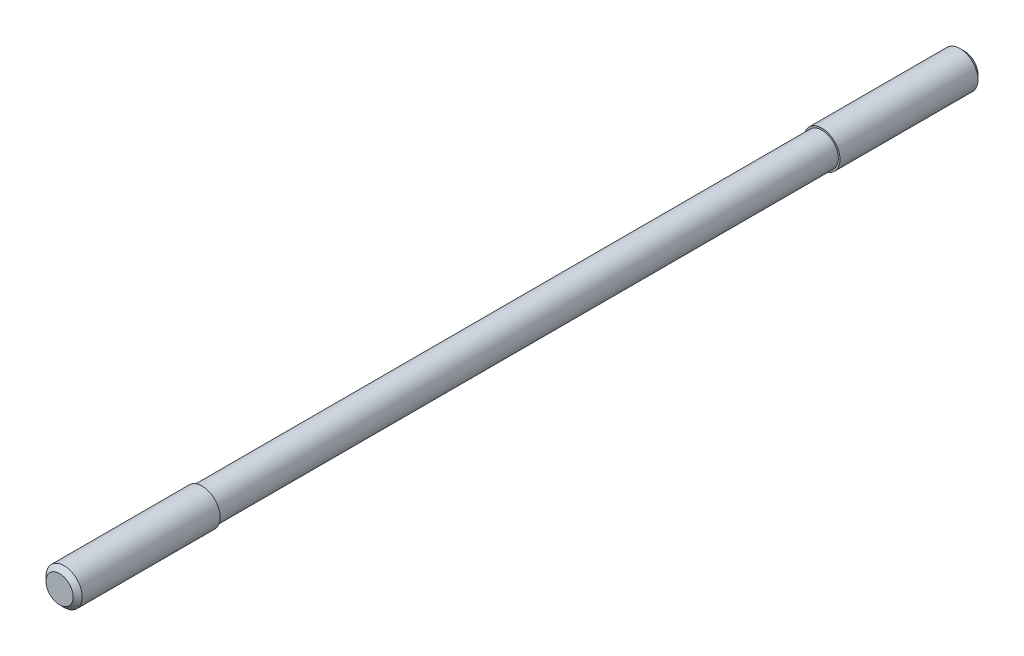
ISO-10303-21;
HEADER;
FILE_DESCRIPTION(('STEP AP214'),'2;1');
FILE_NAME('part.step','',(''),(''),'','','');
FILE_SCHEMA(('AUTOMOTIVE_DESIGN { 1 0 10303 214 1 1 1 1 }'));
ENDSEC;
DATA;
#1=APPLICATION_CONTEXT('core data for automotive mechanical design processes');
#2=APPLICATION_PROTOCOL_DEFINITION('international standard','automotive_design',2000,#1);
#3=PRODUCT_CONTEXT('',#1,'mechanical');
#4=PRODUCT('Part','Part','',(#3));
#5=PRODUCT_RELATED_PRODUCT_CATEGORY('part','',(#4));
#6=PRODUCT_DEFINITION_FORMATION('','',#4);
#7=PRODUCT_DEFINITION_CONTEXT('part definition',#1,'design');
#8=PRODUCT_DEFINITION('design','',#6,#7);
#9=PRODUCT_DEFINITION_SHAPE('','',#8);
#10=(LENGTH_UNIT() NAMED_UNIT(*) SI_UNIT(.MILLI.,.METRE.));
#11=(NAMED_UNIT(*) PLANE_ANGLE_UNIT() SI_UNIT($,.RADIAN.));
#12=(NAMED_UNIT(*) SI_UNIT($,.STERADIAN.) SOLID_ANGLE_UNIT());
#13=UNCERTAINTY_MEASURE_WITH_UNIT(LENGTH_MEASURE(1.E-05),#10,'distance_accuracy_value','');
#14=(GEOMETRIC_REPRESENTATION_CONTEXT(3) GLOBAL_UNCERTAINTY_ASSIGNED_CONTEXT((#13)) GLOBAL_UNIT_ASSIGNED_CONTEXT((#10,
#11,#12)) REPRESENTATION_CONTEXT('',''));
#15=CARTESIAN_POINT('',(0.,0.,0.));
#16=DIRECTION('',(0.,0.,1.));
#17=DIRECTION('',(1.,0.,0.));
#18=AXIS2_PLACEMENT_3D('',#15,#16,#17);
#19=CARTESIAN_POINT('',(0.,0.,0.));
#20=DIRECTION('',(0.,0.,1.));
#21=DIRECTION('',(1.,0.,0.));
#22=AXIS2_PLACEMENT_3D('',#19,#20,#21);
#23=PLANE('',#22);
#24=CARTESIAN_POINT('',(0.,0.,0.));
#25=DIRECTION('',(0.,0.,1.));
#26=DIRECTION('',(1.,0.,0.));
#27=AXIS2_PLACEMENT_3D('',#24,#25,#26);
#28=CIRCLE('',#27,6.);
#29=CARTESIAN_POINT('',(6.,0.,0.));
#30=VERTEX_POINT('',#29);
#31=EDGE_CURVE('E8',#30,#30,#28,.T.);
#32=ORIENTED_EDGE('',*,*,#31,.F.);
#33=EDGE_LOOP('',(#32));
#34=FACE_BOUND('',#33,.T.);
#35=ADVANCED_FACE('F12',(#34),#23,.F.);
#36=CARTESIAN_POINT('',(0.,0.,2.));
#37=DIRECTION('',(0.,0.,1.));
#38=DIRECTION('',(1.,0.,0.));
#39=AXIS2_PLACEMENT_3D('',#36,#37,#38);
#40=CONICAL_SURFACE('',#39,8.,0.785398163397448);
#41=ORIENTED_EDGE('',*,*,#31,.T.);
#42=EDGE_LOOP('',(#41));
#43=FACE_BOUND('',#42,.T.);
#44=CARTESIAN_POINT('',(0.,0.,2.));
#45=DIRECTION('',(0.,0.,1.));
#46=DIRECTION('',(1.,0.,0.));
#47=AXIS2_PLACEMENT_3D('',#44,#45,#46);
#48=CIRCLE('',#47,8.);
#49=CARTESIAN_POINT('',(8.,0.,2.));
#50=VERTEX_POINT('',#49);
#51=EDGE_CURVE('E18',#50,#50,#48,.T.);
#52=ORIENTED_EDGE('',*,*,#51,.F.);
#53=EDGE_LOOP('',(#52));
#54=FACE_BOUND('',#53,.T.);
#55=ADVANCED_FACE('F61',(#43,#54),#40,.T.);
#56=CARTESIAN_POINT('',(0.,0.,70.));
#57=DIRECTION('',(0.,0.,1.));
#58=DIRECTION('',(1.,0.,0.));
#59=AXIS2_PLACEMENT_3D('',#56,#57,#58);
#60=CYLINDRICAL_SURFACE('',#59,8.);
#61=CARTESIAN_POINT('',(0.,0.,63.));
#62=DIRECTION('',(0.,0.,1.));
#63=DIRECTION('',(1.,0.,0.));
#64=AXIS2_PLACEMENT_3D('',#61,#62,#63);
#65=CIRCLE('',#64,8.);
#66=CARTESIAN_POINT('',(8.,0.,63.));
#67=VERTEX_POINT('',#66);
#68=EDGE_CURVE('E22',#67,#67,#65,.T.);
#69=ORIENTED_EDGE('',*,*,#68,.F.);
#70=EDGE_LOOP('',(#69));
#71=FACE_BOUND('',#70,.T.);
#72=ORIENTED_EDGE('',*,*,#51,.T.);
#73=EDGE_LOOP('',(#72));
#74=FACE_BOUND('',#73,.T.);
#75=ADVANCED_FACE('F66',(#71,#74),#60,.T.);
#76=CARTESIAN_POINT('',(8.,0.,63.));
#77=DIRECTION('',(0.,0.,-1.));
#78=DIRECTION('',(-1.,0.,0.));
#79=AXIS2_PLACEMENT_3D('',#76,#77,#78);
#80=PLANE('',#79);
#81=CARTESIAN_POINT('',(0.,0.,63.));
#82=DIRECTION('',(0.,0.,1.));
#83=DIRECTION('',(1.,0.,0.));
#84=AXIS2_PLACEMENT_3D('',#81,#82,#83);
#85=CIRCLE('',#84,7.25);
#86=CARTESIAN_POINT('',(7.25,0.,63.));
#87=VERTEX_POINT('',#86);
#88=EDGE_CURVE('E26',#87,#87,#85,.T.);
#89=ORIENTED_EDGE('',*,*,#88,.F.);
#90=EDGE_LOOP('',(#89));
#91=FACE_BOUND('',#90,.T.);
#92=ORIENTED_EDGE('',*,*,#68,.T.);
#93=EDGE_LOOP('',(#92));
#94=FACE_BOUND('',#93,.T.);
#95=ADVANCED_FACE('F70',(#91,#94),#80,.F.);
#96=CARTESIAN_POINT('',(0.,0.,70.));
#97=DIRECTION('',(0.,0.,1.));
#98=DIRECTION('',(1.,0.,0.));
#99=AXIS2_PLACEMENT_3D('',#96,#97,#98);
#100=CYLINDRICAL_SURFACE('',#99,7.25);
#101=CARTESIAN_POINT('',(0.,0.,337.));
#102=DIRECTION('',(0.,0.,1.));
#103=DIRECTION('',(1.,0.,0.));
#104=AXIS2_PLACEMENT_3D('',#101,#102,#103);
#105=CIRCLE('',#104,7.25);
#106=CARTESIAN_POINT('',(7.25,0.,337.));
#107=VERTEX_POINT('',#106);
#108=EDGE_CURVE('E31',#107,#107,#105,.T.);
#109=ORIENTED_EDGE('',*,*,#108,.F.);
#110=EDGE_LOOP('',(#109));
#111=FACE_BOUND('',#110,.T.);
#112=ORIENTED_EDGE('',*,*,#88,.T.);
#113=EDGE_LOOP('',(#112));
#114=FACE_BOUND('',#113,.T.);
#115=ADVANCED_FACE('F77',(#111,#114),#100,.T.);
#116=CARTESIAN_POINT('',(7.25,0.,337.));
#117=DIRECTION('',(0.,0.,1.));
#118=DIRECTION('',(1.,0.,0.));
#119=AXIS2_PLACEMENT_3D('',#116,#117,#118);
#120=PLANE('',#119);
#121=CARTESIAN_POINT('',(0.,0.,337.));
#122=DIRECTION('',(0.,0.,1.));
#123=DIRECTION('',(1.,0.,0.));
#124=AXIS2_PLACEMENT_3D('',#121,#122,#123);
#125=CIRCLE('',#124,8.);
#126=CARTESIAN_POINT('',(8.,0.,337.));
#127=VERTEX_POINT('',#126);
#128=EDGE_CURVE('E34',#127,#127,#125,.T.);
#129=ORIENTED_EDGE('',*,*,#128,.F.);
#130=EDGE_LOOP('',(#129));
#131=FACE_BOUND('',#130,.T.);
#132=ORIENTED_EDGE('',*,*,#108,.T.);
#133=EDGE_LOOP('',(#132));
#134=FACE_BOUND('',#133,.T.);
#135=ADVANCED_FACE('F57',(#131,#134),#120,.F.);
#136=CARTESIAN_POINT('',(0.,0.,70.));
#137=DIRECTION('',(0.,0.,1.));
#138=DIRECTION('',(1.,0.,0.));
#139=AXIS2_PLACEMENT_3D('',#136,#137,#138);
#140=CYLINDRICAL_SURFACE('',#139,8.);
#141=CARTESIAN_POINT('',(0.,0.,398.));
#142=DIRECTION('',(0.,0.,1.));
#143=DIRECTION('',(1.,0.,0.));
#144=AXIS2_PLACEMENT_3D('',#141,#142,#143);
#145=CIRCLE('',#144,8.);
#146=CARTESIAN_POINT('',(8.,0.,398.));
#147=VERTEX_POINT('',#146);
#148=EDGE_CURVE('E37',#147,#147,#145,.T.);
#149=ORIENTED_EDGE('',*,*,#148,.F.);
#150=EDGE_LOOP('',(#149));
#151=FACE_BOUND('',#150,.T.);
#152=ORIENTED_EDGE('',*,*,#128,.T.);
#153=EDGE_LOOP('',(#152));
#154=FACE_BOUND('',#153,.T.);
#155=ADVANCED_FACE('F48',(#151,#154),#140,.T.);
#156=CARTESIAN_POINT('',(0.,0.,400.));
#157=DIRECTION('',(0.,0.,-1.));
#158=DIRECTION('',(-1.,0.,0.));
#159=AXIS2_PLACEMENT_3D('',#156,#157,#158);
#160=CONICAL_SURFACE('',#159,6.,0.785398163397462);
#161=ORIENTED_EDGE('',*,*,#148,.T.);
#162=EDGE_LOOP('',(#161));
#163=FACE_BOUND('',#162,.T.);
#164=CARTESIAN_POINT('',(0.,0.,400.));
#165=DIRECTION('',(0.,0.,1.));
#166=DIRECTION('',(1.,0.,0.));
#167=AXIS2_PLACEMENT_3D('',#164,#165,#166);
#168=CIRCLE('',#167,6.);
#169=CARTESIAN_POINT('',(6.,0.,400.));
#170=VERTEX_POINT('',#169);
#171=EDGE_CURVE('E40',#170,#170,#168,.T.);
#172=ORIENTED_EDGE('',*,*,#171,.F.);
#173=EDGE_LOOP('',(#172));
#174=FACE_BOUND('',#173,.T.);
#175=ADVANCED_FACE('F46',(#163,#174),#160,.T.);
#176=CARTESIAN_POINT('',(6.,0.,400.));
#177=DIRECTION('',(0.,0.,-1.));
#178=DIRECTION('',(-1.,0.,0.));
#179=AXIS2_PLACEMENT_3D('',#176,#177,#178);
#180=PLANE('',#179);
#181=ORIENTED_EDGE('',*,*,#171,.T.);
#182=EDGE_LOOP('',(#181));
#183=FACE_BOUND('',#182,.T.);
#184=ADVANCED_FACE('F44',(#183),#180,.F.);
#185=CLOSED_SHELL('',(#35,#55,#75,#95,#115,#135,#155,#175,#184));
#186=MANIFOLD_SOLID_BREP('B1',#185);
#187=ADVANCED_BREP_SHAPE_REPRESENTATION('',(#18,#186),#14);
#188=SHAPE_DEFINITION_REPRESENTATION(#9,#187);
ENDSEC;
END-ISO-10303-21;
